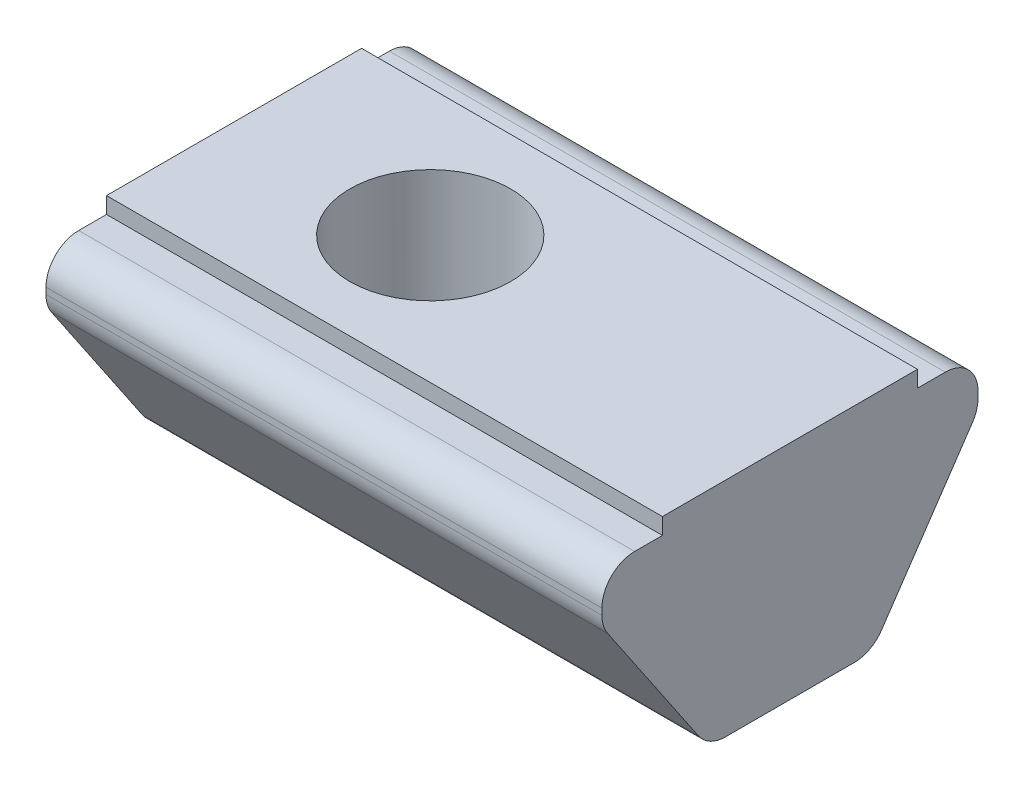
ISO-10303-21;
HEADER;
FILE_DESCRIPTION(('STEP AP214'),'2;1');
FILE_NAME('part.step','',(''),(''),'','','');
FILE_SCHEMA(('AUTOMOTIVE_DESIGN { 1 0 10303 214 1 1 1 1 }'));
ENDSEC;
DATA;
#1=APPLICATION_CONTEXT('core data for automotive mechanical design processes');
#2=APPLICATION_PROTOCOL_DEFINITION('international standard','automotive_design',2000,#1);
#3=PRODUCT_CONTEXT('',#1,'mechanical');
#4=PRODUCT('Part','Part','',(#3));
#5=PRODUCT_RELATED_PRODUCT_CATEGORY('part','',(#4));
#6=PRODUCT_DEFINITION_FORMATION('','',#4);
#7=PRODUCT_DEFINITION_CONTEXT('part definition',#1,'design');
#8=PRODUCT_DEFINITION('design','',#6,#7);
#9=PRODUCT_DEFINITION_SHAPE('','',#8);
#10=(LENGTH_UNIT() NAMED_UNIT(*) SI_UNIT(.MILLI.,.METRE.));
#11=(NAMED_UNIT(*) PLANE_ANGLE_UNIT() SI_UNIT($,.RADIAN.));
#12=(NAMED_UNIT(*) SI_UNIT($,.STERADIAN.) SOLID_ANGLE_UNIT());
#13=UNCERTAINTY_MEASURE_WITH_UNIT(LENGTH_MEASURE(1.E-05),#10,'distance_accuracy_value','');
#14=(GEOMETRIC_REPRESENTATION_CONTEXT(3) GLOBAL_UNCERTAINTY_ASSIGNED_CONTEXT((#13)) GLOBAL_UNIT_ASSIGNED_CONTEXT((#10,
#11,#12)) REPRESENTATION_CONTEXT('',''));
#15=CARTESIAN_POINT('',(0.,0.,0.));
#16=DIRECTION('',(0.,0.,1.));
#17=DIRECTION('',(1.,0.,0.));
#18=AXIS2_PLACEMENT_3D('',#15,#16,#17);
#19=CARTESIAN_POINT('',(11.,-6.8,2.5));
#20=DIRECTION('',(0.,1.,0.));
#21=DIRECTION('',(0.,0.,1.));
#22=AXIS2_PLACEMENT_3D('',#19,#20,#21);
#23=PLANE('',#22);
#24=DIRECTION('',(-1.,0.,0.));
#25=VECTOR('',#24,1.);
#26=CARTESIAN_POINT('',(11.,-6.8,1.96942367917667));
#27=LINE('',#26,#25);
#28=CARTESIAN_POINT('',(6.21786491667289,-6.8,1.96942367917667));
#29=VERTEX_POINT('',#28);
#30=CARTESIAN_POINT('',(1.47159526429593,-6.8,1.96942367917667));
#31=VERTEX_POINT('',#30);
#32=EDGE_CURVE('E197',#29,#31,#27,.T.);
#33=ORIENTED_EDGE('',*,*,#32,.T.);
#34=CARTESIAN_POINT('',(0.,-6.8,0.));
#35=DIRECTION('',(0.,1.,0.));
#36=DIRECTION('',(0.,0.,1.));
#37=AXIS2_PLACEMENT_3D('',#34,#35,#36);
#38=CIRCLE('',#37,2.4585);
#39=CARTESIAN_POINT('',(1.47159526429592,-6.8,-1.96942367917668));
#40=VERTEX_POINT('',#39);
#41=EDGE_CURVE('E54',#31,#40,#38,.T.);
#42=ORIENTED_EDGE('',*,*,#41,.T.);
#43=DIRECTION('',(-1.,0.,0.));
#44=VECTOR('',#43,1.);
#45=CARTESIAN_POINT('',(11.,-6.8,-1.96942367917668));
#46=LINE('',#45,#44);
#47=CARTESIAN_POINT('',(6.2178649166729,-6.8,-1.96942367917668));
#48=VERTEX_POINT('',#47);
#49=EDGE_CURVE('E61',#40,#48,#46,.F.);
#50=ORIENTED_EDGE('',*,*,#49,.T.);
#51=CARTESIAN_POINT('',(7.5,-6.8,0.));
#52=DIRECTION('',(0.,1.,0.));
#53=DIRECTION('',(0.,0.,1.));
#54=AXIS2_PLACEMENT_3D('',#51,#52,#53);
#55=CIRCLE('',#54,2.35);
#56=EDGE_CURVE('E329',#48,#29,#55,.T.);
#57=ORIENTED_EDGE('',*,*,#56,.T.);
#58=EDGE_LOOP('',(#33,#42,#50,#57));
#59=FACE_BOUND('',#58,.T.);
#60=ADVANCED_FACE('F34',(#59),#23,.F.);
#61=CARTESIAN_POINT('',(7.5,-6.6,0.));
#62=DIRECTION('',(0.,-1.,0.));
#63=DIRECTION('',(0.,0.,-1.));
#64=AXIS2_PLACEMENT_3D('',#61,#62,#63);
#65=PLANE('',#64);
#66=CARTESIAN_POINT('',(7.5,-6.6,0.));
#67=DIRECTION('',(0.,1.,0.));
#68=DIRECTION('',(0.,0.,1.));
#69=AXIS2_PLACEMENT_3D('',#66,#67,#68);
#70=CIRCLE('',#69,2.35);
#71=CARTESIAN_POINT('',(7.5,-6.6,2.35));
#72=VERTEX_POINT('',#71);
#73=EDGE_CURVE('E438',#72,#72,#70,.T.);
#74=ORIENTED_EDGE('',*,*,#73,.F.);
#75=EDGE_LOOP('',(#74));
#76=FACE_BOUND('',#75,.T.);
#77=CARTESIAN_POINT('',(7.5,-6.6,0.));
#78=DIRECTION('',(0.,1.,0.));
#79=DIRECTION('',(0.,0.,1.));
#80=AXIS2_PLACEMENT_3D('',#77,#78,#79);
#81=CIRCLE('',#80,1.98997487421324);
#82=CARTESIAN_POINT('',(7.5,-6.6,1.98997487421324));
#83=VERTEX_POINT('',#82);
#84=EDGE_CURVE('E435',#83,#83,#81,.T.);
#85=ORIENTED_EDGE('',*,*,#84,.T.);
#86=EDGE_LOOP('',(#85));
#87=FACE_BOUND('',#86,.T.);
#88=ADVANCED_FACE('F241',(#76,#87),#65,.T.);
#89=CARTESIAN_POINT('',(-6.,-6.8,-1.96942367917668));
#90=VERTEX_POINT('',#89);
#91=CARTESIAN_POINT('',(-1.47159526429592,-6.8,-1.96942367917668));
#92=VERTEX_POINT('',#91);
#93=EDGE_CURVE('E190',#90,#92,#46,.F.);
#94=ORIENTED_EDGE('',*,*,#93,.T.);
#95=CARTESIAN_POINT('',(-1.47159526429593,-6.8,1.96942367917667));
#96=VERTEX_POINT('',#95);
#97=EDGE_CURVE('E177',#92,#96,#38,.T.);
#98=ORIENTED_EDGE('',*,*,#97,.T.);
#99=CARTESIAN_POINT('',(-6.,-6.8,1.96942367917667));
#100=VERTEX_POINT('',#99);
#101=EDGE_CURVE('E187',#96,#100,#27,.T.);
#102=ORIENTED_EDGE('',*,*,#101,.T.);
#103=DIRECTION('',(0.,0.,-1.));
#104=VECTOR('',#103,1.);
#105=CARTESIAN_POINT('',(-6.,-6.8,2.5));
#106=LINE('',#105,#104);
#107=EDGE_CURVE('E398',#100,#90,#106,.T.);
#108=ORIENTED_EDGE('',*,*,#107,.T.);
#109=EDGE_LOOP('',(#94,#98,#102,#108));
#110=FACE_BOUND('',#109,.T.);
#111=ADVANCED_FACE('F185',(#110),#23,.F.);
#112=CARTESIAN_POINT('',(8.78213508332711,-6.8,1.96942367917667));
#113=VERTEX_POINT('',#112);
#114=CARTESIAN_POINT('',(8.78213508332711,-6.8,-1.96942367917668));
#115=VERTEX_POINT('',#114);
#116=EDGE_CURVE('E256',#113,#115,#55,.T.);
#117=ORIENTED_EDGE('',*,*,#116,.T.);
#118=CARTESIAN_POINT('',(11.,-6.8,-1.96942367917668));
#119=VERTEX_POINT('',#118);
#120=EDGE_CURVE('E201',#115,#119,#46,.F.);
#121=ORIENTED_EDGE('',*,*,#120,.T.);
#122=DIRECTION('',(0.,0.,-1.));
#123=VECTOR('',#122,1.);
#124=CARTESIAN_POINT('',(11.,-6.8,2.5));
#125=LINE('',#124,#123);
#126=CARTESIAN_POINT('',(11.,-6.8,1.96942367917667));
#127=VERTEX_POINT('',#126);
#128=EDGE_CURVE('E420',#127,#119,#125,.T.);
#129=ORIENTED_EDGE('',*,*,#128,.F.);
#130=EDGE_CURVE('E199',#127,#113,#27,.T.);
#131=ORIENTED_EDGE('',*,*,#130,.T.);
#132=EDGE_LOOP('',(#117,#121,#129,#131));
#133=FACE_BOUND('',#132,.T.);
#134=ADVANCED_FACE('F263',(#133),#23,.F.);
#135=CARTESIAN_POINT('',(11.,-5.8,1.96942367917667));
#136=DIRECTION('',(-1.,0.,0.));
#137=DIRECTION('',(0.,0.,1.));
#138=AXIS2_PLACEMENT_3D('',#135,#136,#137);
#139=CYLINDRICAL_SURFACE('',#138,1.);
#140=CARTESIAN_POINT('',(1.47159526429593,-6.8,1.96942367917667));
#141=CARTESIAN_POINT('',(1.42306226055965,-6.79998169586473,2.00569675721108));
#142=CARTESIAN_POINT('',(1.37322881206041,-6.79802838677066,2.04012966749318));
#143=CARTESIAN_POINT('',(1.27136263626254,-6.79129349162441,2.10511159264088));
#144=CARTESIAN_POINT('',(1.21933310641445,-6.78651589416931,2.13566601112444));
#145=CARTESIAN_POINT('',(1.11318285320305,-6.77515167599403,2.19287396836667));
#146=CARTESIAN_POINT('',(1.05905646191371,-6.76855980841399,2.21951584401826));
#147=CARTESIAN_POINT('',(0.949069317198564,-6.7545015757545,2.26872655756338));
#148=CARTESIAN_POINT('',(0.893207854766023,-6.74703484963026,2.29129370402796));
#149=CARTESIAN_POINT('',(0.777285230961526,-6.73174924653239,2.33324411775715));
#150=CARTESIAN_POINT('',(0.717150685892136,-6.72393050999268,2.35242492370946));
#151=CARTESIAN_POINT('',(0.595479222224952,-6.70922787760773,2.38612883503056));
#152=CARTESIAN_POINT('',(0.533942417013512,-6.70234390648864,2.40065231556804));
#153=CARTESIAN_POINT('',(0.409935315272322,-6.69034932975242,2.42490297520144));
#154=CARTESIAN_POINT('',(0.3474681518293,-6.6852337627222,2.43464360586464));
#155=CARTESIAN_POINT('',(0.221818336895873,-6.67738164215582,2.44928942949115));
#156=CARTESIAN_POINT('',(0.158635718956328,-6.67464497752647,2.45419484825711));
#157=CARTESIAN_POINT('',(0.0293997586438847,-6.67184852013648,2.45920910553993));
#158=CARTESIAN_POINT('',(-0.0366643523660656,-6.67190397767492,2.45911142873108));
#159=CARTESIAN_POINT('',(-0.168502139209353,-6.67497222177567,2.45360632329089));
#160=CARTESIAN_POINT('',(-0.234275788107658,-6.67798527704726,2.44819841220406));
#161=CARTESIAN_POINT('',(-0.365209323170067,-6.68656352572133,2.4321198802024));
#162=CARTESIAN_POINT('',(-0.430366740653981,-6.6921364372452,2.42143333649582));
#163=CARTESIAN_POINT('',(-0.559441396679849,-6.70508357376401,2.39491059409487));
#164=CARTESIAN_POINT('',(-0.623358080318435,-6.71245858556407,2.37907214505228));
#165=CARTESIAN_POINT('',(-0.807497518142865,-6.73523897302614,2.32551578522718));
#166=CARTESIAN_POINT('',(-0.925715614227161,-6.75181649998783,2.28103992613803));
#167=CARTESIAN_POINT('',(-1.09688437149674,-6.773168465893,2.2011419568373));
#168=CARTESIAN_POINT('',(-1.15283134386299,-6.77969257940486,2.17236729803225));
#169=CARTESIAN_POINT('',(-1.26250969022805,-6.79049652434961,2.11050752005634));
#170=CARTESIAN_POINT('',(-1.31624272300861,-6.79477806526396,2.07742570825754));
#171=CARTESIAN_POINT('',(-1.40357920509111,-6.79904826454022,2.01890117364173));
#172=CARTESIAN_POINT('',(-1.43790836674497,-6.79999341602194,1.99460052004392));
#173=CARTESIAN_POINT('',(-1.47159526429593,-6.8,1.96942367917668));
#174=B_SPLINE_CURVE_WITH_KNOTS('',3,(#140,#141,#142,#143,#144,#145,#146,#147,#148,#149,#150,
#151,#152,#153,#154,#155,#156,#157,#158,#159,#160,#161,#162,#163,#164,#165,#166,#167,#168,#169,
#170,#171,#172,#173),.UNSPECIFIED.,.F.,.F.,(4,2,2,2,2,2,2,2,2,2,2,2,2,2,2,2,4),(0.,
0.181614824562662,0.362973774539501,0.544862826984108,0.726827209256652,0.917445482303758,
1.10804839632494,1.29811213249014,1.4881669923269,1.68607292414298,1.88399683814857,
2.08252146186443,2.28113291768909,2.66151335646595,2.85111024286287,3.04056239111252,
3.16669757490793),.UNSPECIFIED.);
#175=EDGE_CURVE('E11',#31,#96,#174,.T.);
#176=ORIENTED_EDGE('',*,*,#175,.F.);
#177=ORIENTED_EDGE('',*,*,#32,.F.);
#178=CARTESIAN_POINT('',(6.21786491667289,-6.8,1.96942367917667));
#179=CARTESIAN_POINT('',(6.26941318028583,-6.7999783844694,2.00298939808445));
#180=CARTESIAN_POINT('',(6.32224458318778,-6.79831126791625,2.03449549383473));
#181=CARTESIAN_POINT('',(6.43007862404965,-6.79275195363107,2.09320956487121));
#182=CARTESIAN_POINT('',(6.48507930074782,-6.78886172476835,2.12042131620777));
#183=CARTESIAN_POINT('',(6.5970877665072,-6.77990723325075,2.17048964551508));
#184=CARTESIAN_POINT('',(6.65410018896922,-6.77484008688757,2.19333527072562));
#185=CARTESIAN_POINT('',(6.76973175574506,-6.76446242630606,2.2344965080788));
#186=CARTESIAN_POINT('',(6.8283512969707,-6.75915185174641,2.25281098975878));
#187=CARTESIAN_POINT('',(6.94888236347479,-6.74894438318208,2.28534355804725));
#188=CARTESIAN_POINT('',(7.01083836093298,-6.74406733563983,2.2994036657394));
#189=CARTESIAN_POINT('',(7.13577445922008,-6.7356860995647,2.32247152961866));
#190=CARTESIAN_POINT('',(7.19875446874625,-6.73218178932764,2.33147973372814));
#191=CARTESIAN_POINT('',(7.32518942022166,-6.72708124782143,2.34434859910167));
#192=CARTESIAN_POINT('',(7.38864313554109,-6.72548114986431,2.34821969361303));
#193=CARTESIAN_POINT('',(7.51567264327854,-6.72441846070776,2.3508062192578));
#194=CARTESIAN_POINT('',(7.57924843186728,-6.72495580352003,2.34952180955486));
#195=CARTESIAN_POINT('',(7.70530115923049,-6.72806792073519,2.34185667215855));
#196=CARTESIAN_POINT('',(7.76778230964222,-6.73061909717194,2.33553496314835));
#197=CARTESIAN_POINT('',(7.89195507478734,-6.73735308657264,2.31793111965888));
#198=CARTESIAN_POINT('',(7.95364659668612,-6.7415360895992,2.30664840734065));
#199=CARTESIAN_POINT('',(8.07590856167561,-6.75091949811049,2.27920115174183));
#200=CARTESIAN_POINT('',(8.13647799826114,-6.75612077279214,2.26303243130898));
#201=CARTESIAN_POINT('',(8.25611724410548,-6.76673811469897,2.22591828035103));
#202=CARTESIAN_POINT('',(8.31518681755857,-6.77215421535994,2.20497210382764));
#203=CARTESIAN_POINT('',(8.44469791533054,-6.78341725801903,2.15312433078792));
#204=CARTESIAN_POINT('',(8.51469137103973,-6.78908479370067,2.1210426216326));
#205=CARTESIAN_POINT('',(8.61707529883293,-6.79530060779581,2.06787787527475));
#206=CARTESIAN_POINT('',(8.65073584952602,-6.7969910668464,2.04933742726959));
#207=CARTESIAN_POINT('',(8.71714378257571,-6.79933946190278,2.01060666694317));
#208=CARTESIAN_POINT('',(8.74989087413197,-6.79999707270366,1.99041583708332));
#209=CARTESIAN_POINT('',(8.78213508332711,-6.8,1.96942367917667));
#210=B_SPLINE_CURVE_WITH_KNOTS('',3,(#178,#179,#180,#181,#182,#183,#184,#185,#186,#187,#188,
#189,#190,#191,#192,#193,#194,#195,#196,#197,#198,#199,#200,#201,#202,#203,#204,#205,#206,#207,
#208,#209),.UNSPECIFIED.,.F.,.F.,(4,2,2,2,2,2,2,2,2,2,2,2,2,2,2,4),(0.,0.184403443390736,
0.368643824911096,0.553340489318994,0.738083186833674,0.929021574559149,1.11994303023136,
1.31047613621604,1.50100335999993,1.6893305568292,1.87767969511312,2.06619031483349,
2.25473039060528,2.4858939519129,2.6012403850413,2.71662312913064),.UNSPECIFIED.);
#211=EDGE_CURVE('E247',#29,#113,#210,.T.);
#212=ORIENTED_EDGE('',*,*,#211,.T.);
#213=ORIENTED_EDGE('',*,*,#130,.F.);
#214=CARTESIAN_POINT('',(11.,-5.8,1.96942367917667));
#215=DIRECTION('',(1.,0.,0.));
#216=DIRECTION('',(0.,0.,-1.));
#217=AXIS2_PLACEMENT_3D('',#214,#215,#216);
#218=CIRCLE('',#217,1.);
#219=CARTESIAN_POINT('',(11.,-6.36065740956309,2.79747154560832));
#220=VERTEX_POINT('',#219);
#221=EDGE_CURVE('E344',#220,#127,#218,.T.);
#222=ORIENTED_EDGE('',*,*,#221,.F.);
#223=DIRECTION('',(-1.,0.,0.));
#224=VECTOR('',#223,1.);
#225=CARTESIAN_POINT('',(11.,-6.36065740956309,2.79747154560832));
#226=LINE('',#225,#224);
#227=CARTESIAN_POINT('',(-6.,-6.36065740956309,2.79747154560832));
#228=VERTEX_POINT('',#227);
#229=EDGE_CURVE('E336',#228,#220,#226,.F.);
#230=ORIENTED_EDGE('',*,*,#229,.F.);
#231=CARTESIAN_POINT('',(-6.,-5.8,1.96942367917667));
#232=DIRECTION('',(1.,0.,0.));
#233=DIRECTION('',(0.,0.,-1.));
#234=AXIS2_PLACEMENT_3D('',#231,#232,#233);
#235=CIRCLE('',#234,1.);
#236=EDGE_CURVE('E195',#100,#228,#235,.F.);
#237=ORIENTED_EDGE('',*,*,#236,.F.);
#238=ORIENTED_EDGE('',*,*,#101,.F.);
#239=EDGE_LOOP('',(#176,#177,#212,#213,#222,#230,#237,#238));
#240=FACE_BOUND('',#239,.T.);
#241=ADVANCED_FACE('F193',(#240),#139,.T.);
#242=CARTESIAN_POINT('',(11.,-5.8,-1.96942367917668));
#243=DIRECTION('',(-1.,0.,0.));
#244=DIRECTION('',(0.,0.,1.));
#245=AXIS2_PLACEMENT_3D('',#242,#243,#244);
#246=CYLINDRICAL_SURFACE('',#245,1.);
#247=CARTESIAN_POINT('',(-1.47159526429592,-6.8,-1.96942367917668));
#248=CARTESIAN_POINT('',(-1.42306226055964,-6.79998169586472,-2.00569675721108));
#249=CARTESIAN_POINT('',(-1.3732288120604,-6.79802838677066,-2.04012966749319));
#250=CARTESIAN_POINT('',(-1.27136263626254,-6.79129349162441,-2.10511159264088));
#251=CARTESIAN_POINT('',(-1.21933310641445,-6.78651589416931,-2.13566601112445));
#252=CARTESIAN_POINT('',(-1.11318285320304,-6.77515167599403,-2.19287396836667));
#253=CARTESIAN_POINT('',(-1.0590564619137,-6.76855980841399,-2.21951584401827));
#254=CARTESIAN_POINT('',(-0.949069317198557,-6.7545015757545,-2.26872655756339));
#255=CARTESIAN_POINT('',(-0.893207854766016,-6.74703484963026,-2.29129370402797));
#256=CARTESIAN_POINT('',(-0.777285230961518,-6.73174924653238,-2.33324411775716));
#257=CARTESIAN_POINT('',(-0.717150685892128,-6.72393050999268,-2.35242492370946));
#258=CARTESIAN_POINT('',(-0.595479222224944,-6.70922787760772,-2.38612883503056));
#259=CARTESIAN_POINT('',(-0.533942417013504,-6.70234390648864,-2.40065231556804));
#260=CARTESIAN_POINT('',(-0.409935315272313,-6.69034932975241,-2.42490297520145));
#261=CARTESIAN_POINT('',(-0.347468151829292,-6.6852337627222,-2.43464360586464));
#262=CARTESIAN_POINT('',(-0.221818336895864,-6.67738164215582,-2.44928942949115));
#263=CARTESIAN_POINT('',(-0.158635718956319,-6.67464497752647,-2.45419484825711));
#264=CARTESIAN_POINT('',(-0.0293997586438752,-6.67184852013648,-2.45920910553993));
#265=CARTESIAN_POINT('',(0.0366643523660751,-6.67190397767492,-2.45911142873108));
#266=CARTESIAN_POINT('',(0.168502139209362,-6.67497222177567,-2.45360632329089));
#267=CARTESIAN_POINT('',(0.234275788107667,-6.67798527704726,-2.44819841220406));
#268=CARTESIAN_POINT('',(0.365209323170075,-6.68656352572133,-2.4321198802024));
#269=CARTESIAN_POINT('',(0.430366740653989,-6.6921364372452,-2.42143333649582));
#270=CARTESIAN_POINT('',(0.559441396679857,-6.70508357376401,-2.39491059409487));
#271=CARTESIAN_POINT('',(0.623358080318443,-6.71245858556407,-2.37907214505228));
#272=CARTESIAN_POINT('',(0.807497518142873,-6.73523897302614,-2.32551578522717));
#273=CARTESIAN_POINT('',(0.925715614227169,-6.75181649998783,-2.28103992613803));
#274=CARTESIAN_POINT('',(1.09688437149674,-6.773168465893,-2.20114195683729));
#275=CARTESIAN_POINT('',(1.152831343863,-6.77969257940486,-2.17236729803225));
#276=CARTESIAN_POINT('',(1.26250969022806,-6.79049652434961,-2.11050752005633));
#277=CARTESIAN_POINT('',(1.31624272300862,-6.79477806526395,-2.07742570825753));
#278=CARTESIAN_POINT('',(1.40357920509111,-6.79904826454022,-2.01890117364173));
#279=CARTESIAN_POINT('',(1.43790836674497,-6.79999341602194,-1.99460052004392));
#280=CARTESIAN_POINT('',(1.47159526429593,-6.8,-1.96942367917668));
#281=B_SPLINE_CURVE_WITH_KNOTS('',3,(#247,#248,#249,#250,#251,#252,#253,#254,#255,#256,#257,
#258,#259,#260,#261,#262,#263,#264,#265,#266,#267,#268,#269,#270,#271,#272,#273,#274,#275,#276,
#277,#278,#279,#280),.UNSPECIFIED.,.F.,.F.,(4,2,2,2,2,2,2,2,2,2,2,2,2,2,2,2,4),(0.,
0.181614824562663,0.362973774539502,0.544862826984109,0.726827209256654,0.917445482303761,
1.10804839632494,1.29811213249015,1.4881669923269,1.68607292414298,1.88399683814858,
2.08252146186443,2.28113291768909,2.66151335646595,2.85111024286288,3.04056239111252,
3.16669757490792),.UNSPECIFIED.);
#282=EDGE_CURVE('E434',#92,#40,#281,.T.);
#283=ORIENTED_EDGE('',*,*,#282,.F.);
#284=ORIENTED_EDGE('',*,*,#93,.F.);
#285=CARTESIAN_POINT('',(-6.,-5.8,-1.96942367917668));
#286=DIRECTION('',(1.,0.,0.));
#287=DIRECTION('',(0.,0.,-1.));
#288=AXIS2_PLACEMENT_3D('',#285,#286,#287);
#289=CIRCLE('',#288,1.);
#290=CARTESIAN_POINT('',(-6.,-6.36065740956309,-2.79747154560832));
#291=VERTEX_POINT('',#290);
#292=EDGE_CURVE('E358',#291,#90,#289,.F.);
#293=ORIENTED_EDGE('',*,*,#292,.F.);
#294=DIRECTION('',(-1.,0.,0.));
#295=VECTOR('',#294,1.);
#296=CARTESIAN_POINT('',(11.,-6.36065740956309,-2.79747154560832));
#297=LINE('',#296,#295);
#298=CARTESIAN_POINT('',(11.,-6.36065740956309,-2.79747154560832));
#299=VERTEX_POINT('',#298);
#300=EDGE_CURVE('E209',#299,#291,#297,.T.);
#301=ORIENTED_EDGE('',*,*,#300,.F.);
#302=CARTESIAN_POINT('',(11.,-5.8,-1.96942367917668));
#303=DIRECTION('',(1.,0.,0.));
#304=DIRECTION('',(0.,0.,-1.));
#305=AXIS2_PLACEMENT_3D('',#302,#303,#304);
#306=CIRCLE('',#305,1.);
#307=EDGE_CURVE('E333',#119,#299,#306,.T.);
#308=ORIENTED_EDGE('',*,*,#307,.F.);
#309=ORIENTED_EDGE('',*,*,#120,.F.);
#310=CARTESIAN_POINT('',(8.7821350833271,-6.8,-1.96942367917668));
#311=CARTESIAN_POINT('',(8.73058681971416,-6.7999783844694,-2.00298939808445));
#312=CARTESIAN_POINT('',(8.67775541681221,-6.79831126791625,-2.03449549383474));
#313=CARTESIAN_POINT('',(8.56992137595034,-6.79275195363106,-2.09320956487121));
#314=CARTESIAN_POINT('',(8.51492069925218,-6.78886172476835,-2.12042131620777));
#315=CARTESIAN_POINT('',(8.40291223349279,-6.77990723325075,-2.17048964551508));
#316=CARTESIAN_POINT('',(8.34589981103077,-6.77484008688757,-2.19333527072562));
#317=CARTESIAN_POINT('',(8.23026824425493,-6.76446242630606,-2.23449650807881));
#318=CARTESIAN_POINT('',(8.17164870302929,-6.75915185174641,-2.25281098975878));
#319=CARTESIAN_POINT('',(8.0511176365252,-6.74894438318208,-2.28534355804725));
#320=CARTESIAN_POINT('',(7.98916163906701,-6.74406733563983,-2.2994036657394));
#321=CARTESIAN_POINT('',(7.8642255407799,-6.7356860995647,-2.32247152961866));
#322=CARTESIAN_POINT('',(7.80124553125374,-6.73218178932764,-2.33147973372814));
#323=CARTESIAN_POINT('',(7.67481057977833,-6.72708124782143,-2.34434859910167));
#324=CARTESIAN_POINT('',(7.6113568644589,-6.72548114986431,-2.34821969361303));
#325=CARTESIAN_POINT('',(7.48432735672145,-6.72441846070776,-2.35080621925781));
#326=CARTESIAN_POINT('',(7.42075156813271,-6.72495580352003,-2.34952180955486));
#327=CARTESIAN_POINT('',(7.2946988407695,-6.72806792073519,-2.34185667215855));
#328=CARTESIAN_POINT('',(7.23221769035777,-6.73061909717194,-2.33553496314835));
#329=CARTESIAN_POINT('',(7.10804492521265,-6.73735308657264,-2.31793111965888));
#330=CARTESIAN_POINT('',(7.04635340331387,-6.7415360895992,-2.30664840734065));
#331=CARTESIAN_POINT('',(6.92409143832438,-6.75091949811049,-2.27920115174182));
#332=CARTESIAN_POINT('',(6.86352200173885,-6.75612077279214,-2.26303243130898));
#333=CARTESIAN_POINT('',(6.74388275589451,-6.76673811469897,-2.22591828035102));
#334=CARTESIAN_POINT('',(6.68481318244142,-6.77215421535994,-2.20497210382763));
#335=CARTESIAN_POINT('',(6.55530208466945,-6.78341725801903,-2.15312433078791));
#336=CARTESIAN_POINT('',(6.48530862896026,-6.78908479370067,-2.1210426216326));
#337=CARTESIAN_POINT('',(6.38292470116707,-6.79530060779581,-2.06787787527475));
#338=CARTESIAN_POINT('',(6.34926415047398,-6.79699106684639,-2.0493374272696));
#339=CARTESIAN_POINT('',(6.2828562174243,-6.79933946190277,-2.01060666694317));
#340=CARTESIAN_POINT('',(6.25010912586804,-6.79999707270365,-1.99041583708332));
#341=CARTESIAN_POINT('',(6.2178649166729,-6.8,-1.96942367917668));
#342=B_SPLINE_CURVE_WITH_KNOTS('',3,(#310,#311,#312,#313,#314,#315,#316,#317,#318,#319,#320,
#321,#322,#323,#324,#325,#326,#327,#328,#329,#330,#331,#332,#333,#334,#335,#336,#337,#338,#339,
#340,#341),.UNSPECIFIED.,.F.,.F.,(4,2,2,2,2,2,2,2,2,2,2,2,2,2,2,4),(0.,0.184403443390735,
0.368643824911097,0.553340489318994,0.738083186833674,0.929021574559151,1.11994303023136,
1.31047613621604,1.50100335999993,1.6893305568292,1.87767969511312,2.06619031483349,
2.25473039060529,2.48589395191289,2.60124038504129,2.71662312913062),.UNSPECIFIED.);
#343=EDGE_CURVE('E48',#115,#48,#342,.T.);
#344=ORIENTED_EDGE('',*,*,#343,.T.);
#345=ORIENTED_EDGE('',*,*,#49,.F.);
#346=EDGE_LOOP('',(#283,#284,#293,#301,#308,#309,#344,#345));
#347=FACE_BOUND('',#346,.T.);
#348=ADVANCED_FACE('F232',(#347),#246,.T.);
#349=CARTESIAN_POINT('',(11.,-0.500000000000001,5.75));
#350=DIRECTION('',(0.,0.,-1.));
#351=DIRECTION('',(-1.,0.,0.));
#352=AXIS2_PLACEMENT_3D('',#349,#350,#351);
#353=PLANE('',#352);
#354=DIRECTION('',(0.,-1.,0.));
#355=VECTOR('',#354,1.);
#356=CARTESIAN_POINT('',(11.,-0.500000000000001,5.75));
#357=LINE('',#356,#355);
#358=CARTESIAN_POINT('',(11.,-1.5,5.75));
#359=VERTEX_POINT('',#358);
#360=CARTESIAN_POINT('',(11.,-1.69330266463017,5.75));
#361=VERTEX_POINT('',#360);
#362=EDGE_CURVE('E258',#359,#361,#357,.T.);
#363=ORIENTED_EDGE('',*,*,#362,.F.);
#364=DIRECTION('',(-1.,0.,0.));
#365=VECTOR('',#364,1.);
#366=CARTESIAN_POINT('',(11.,-1.5,5.75));
#367=LINE('',#366,#365);
#368=CARTESIAN_POINT('',(-6.,-1.5,5.75));
#369=VERTEX_POINT('',#368);
#370=EDGE_CURVE('E364',#359,#369,#367,.T.);
#371=ORIENTED_EDGE('',*,*,#370,.T.);
#372=DIRECTION('',(0.,-1.,0.));
#373=VECTOR('',#372,1.);
#374=CARTESIAN_POINT('',(-6.,-0.500000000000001,5.75));
#375=LINE('',#374,#373);
#376=CARTESIAN_POINT('',(-6.,-1.69330266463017,5.75));
#377=VERTEX_POINT('',#376);
#378=EDGE_CURVE('E255',#369,#377,#375,.T.);
#379=ORIENTED_EDGE('',*,*,#378,.T.);
#380=DIRECTION('',(-1.,0.,0.));
#381=VECTOR('',#380,1.);
#382=CARTESIAN_POINT('',(11.,-1.69330266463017,5.75));
#383=LINE('',#382,#381);
#384=EDGE_CURVE('E367',#377,#361,#383,.F.);
#385=ORIENTED_EDGE('',*,*,#384,.T.);
#386=EDGE_LOOP('',(#363,#371,#379,#385));
#387=FACE_BOUND('',#386,.T.);
#388=ADVANCED_FACE('F275',(#387),#353,.F.);
#389=CARTESIAN_POINT('',(11.,-2.,5.75));
#390=DIRECTION('',(0.,0.560657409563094,-0.828047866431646));
#391=DIRECTION('',(0.,0.828047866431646,0.560657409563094));
#392=AXIS2_PLACEMENT_3D('',#389,#390,#391);
#393=PLANE('',#392);
#394=DIRECTION('',(0.,-0.828047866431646,-0.560657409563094));
#395=VECTOR('',#394,1.);
#396=CARTESIAN_POINT('',(11.,-2.,5.75));
#397=LINE('',#396,#395);
#398=CARTESIAN_POINT('',(11.,-2.25396007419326,5.57804786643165));
#399=VERTEX_POINT('',#398);
#400=EDGE_CURVE('E421',#399,#220,#397,.T.);
#401=ORIENTED_EDGE('',*,*,#400,.F.);
#402=DIRECTION('',(-1.,0.,0.));
#403=VECTOR('',#402,1.);
#404=CARTESIAN_POINT('',(11.,-2.25396007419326,5.57804786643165));
#405=LINE('',#404,#403);
#406=CARTESIAN_POINT('',(-6.,-2.25396007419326,5.57804786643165));
#407=VERTEX_POINT('',#406);
#408=EDGE_CURVE('E334',#399,#407,#405,.T.);
#409=ORIENTED_EDGE('',*,*,#408,.T.);
#410=DIRECTION('',(0.,-0.828047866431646,-0.560657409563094));
#411=VECTOR('',#410,1.);
#412=CARTESIAN_POINT('',(-6.,-2.,5.75));
#413=LINE('',#412,#411);
#414=EDGE_CURVE('E400',#407,#228,#413,.T.);
#415=ORIENTED_EDGE('',*,*,#414,.T.);
#416=ORIENTED_EDGE('',*,*,#229,.T.);
#417=EDGE_LOOP('',(#401,#409,#415,#416));
#418=FACE_BOUND('',#417,.T.);
#419=ADVANCED_FACE('F278',(#418),#393,.F.);
#420=CARTESIAN_POINT('',(11.,-6.8,-2.5));
#421=DIRECTION('',(0.,0.560657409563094,0.828047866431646));
#422=DIRECTION('',(0.,-0.828047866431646,0.560657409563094));
#423=AXIS2_PLACEMENT_3D('',#420,#421,#422);
#424=PLANE('',#423);
#425=DIRECTION('',(0.,0.828047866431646,-0.560657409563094));
#426=VECTOR('',#425,1.);
#427=CARTESIAN_POINT('',(11.,-6.8,-2.5));
#428=LINE('',#427,#426);
#429=CARTESIAN_POINT('',(11.,-2.25396007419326,-5.57804786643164));
#430=VERTEX_POINT('',#429);
#431=EDGE_CURVE('E418',#299,#430,#428,.T.);
#432=ORIENTED_EDGE('',*,*,#431,.F.);
#433=ORIENTED_EDGE('',*,*,#300,.T.);
#434=DIRECTION('',(0.,0.828047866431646,-0.560657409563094));
#435=VECTOR('',#434,1.);
#436=CARTESIAN_POINT('',(-6.,-6.8,-2.5));
#437=LINE('',#436,#435);
#438=CARTESIAN_POINT('',(-6.,-2.25396007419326,-5.57804786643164));
#439=VERTEX_POINT('',#438);
#440=EDGE_CURVE('E396',#291,#439,#437,.T.);
#441=ORIENTED_EDGE('',*,*,#440,.T.);
#442=DIRECTION('',(-1.,0.,0.));
#443=VECTOR('',#442,1.);
#444=CARTESIAN_POINT('',(11.,-2.25396007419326,-5.57804786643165));
#445=LINE('',#444,#443);
#446=EDGE_CURVE('E204',#439,#430,#445,.F.);
#447=ORIENTED_EDGE('',*,*,#446,.T.);
#448=EDGE_LOOP('',(#432,#433,#441,#447));
#449=FACE_BOUND('',#448,.T.);
#450=ADVANCED_FACE('F282',(#449),#424,.F.);
#451=CARTESIAN_POINT('',(11.,-2.,-5.75));
#452=DIRECTION('',(0.,0.,1.));
#453=DIRECTION('',(1.,0.,0.));
#454=AXIS2_PLACEMENT_3D('',#451,#452,#453);
#455=PLANE('',#454);
#456=DIRECTION('',(0.,1.,0.));
#457=VECTOR('',#456,1.);
#458=CARTESIAN_POINT('',(11.,-2.,-5.75));
#459=LINE('',#458,#457);
#460=CARTESIAN_POINT('',(11.,-1.69330266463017,-5.75));
#461=VERTEX_POINT('',#460);
#462=CARTESIAN_POINT('',(11.,-1.5,-5.75));
#463=VERTEX_POINT('',#462);
#464=EDGE_CURVE('E415',#461,#463,#459,.T.);
#465=ORIENTED_EDGE('',*,*,#464,.F.);
#466=DIRECTION('',(-1.,0.,0.));
#467=VECTOR('',#466,1.);
#468=CARTESIAN_POINT('',(11.,-1.69330266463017,-5.75));
#469=LINE('',#468,#467);
#470=CARTESIAN_POINT('',(-6.,-1.69330266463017,-5.75));
#471=VERTEX_POINT('',#470);
#472=EDGE_CURVE('E220',#461,#471,#469,.T.);
#473=ORIENTED_EDGE('',*,*,#472,.T.);
#474=DIRECTION('',(0.,1.,0.));
#475=VECTOR('',#474,1.);
#476=CARTESIAN_POINT('',(-6.,-2.,-5.75));
#477=LINE('',#476,#475);
#478=CARTESIAN_POINT('',(-6.,-1.5,-5.75));
#479=VERTEX_POINT('',#478);
#480=EDGE_CURVE('E393',#471,#479,#477,.T.);
#481=ORIENTED_EDGE('',*,*,#480,.T.);
#482=DIRECTION('',(-1.,0.,0.));
#483=VECTOR('',#482,1.);
#484=CARTESIAN_POINT('',(11.,-1.5,-5.75));
#485=LINE('',#484,#483);
#486=EDGE_CURVE('E216',#479,#463,#485,.F.);
#487=ORIENTED_EDGE('',*,*,#486,.T.);
#488=EDGE_LOOP('',(#465,#473,#481,#487));
#489=FACE_BOUND('',#488,.T.);
#490=ADVANCED_FACE('F288',(#489),#455,.F.);
#491=CARTESIAN_POINT('',(11.,-0.499999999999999,-5.75));
#492=DIRECTION('',(0.,-1.,0.));
#493=DIRECTION('',(0.,0.,-1.));
#494=AXIS2_PLACEMENT_3D('',#491,#492,#493);
#495=PLANE('',#494);
#496=DIRECTION('',(0.,0.,1.));
#497=VECTOR('',#496,1.);
#498=CARTESIAN_POINT('',(11.,-0.499999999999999,-5.75));
#499=LINE('',#498,#497);
#500=CARTESIAN_POINT('',(11.,-0.499999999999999,-4.75));
#501=VERTEX_POINT('',#500);
#502=CARTESIAN_POINT('',(11.,-0.499999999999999,-3.9));
#503=VERTEX_POINT('',#502);
#504=EDGE_CURVE('E413',#501,#503,#499,.T.);
#505=ORIENTED_EDGE('',*,*,#504,.F.);
#506=DIRECTION('',(-1.,0.,0.));
#507=VECTOR('',#506,1.);
#508=CARTESIAN_POINT('',(11.,-0.499999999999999,-4.75));
#509=LINE('',#508,#507);
#510=CARTESIAN_POINT('',(-6.,-0.499999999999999,-4.75));
#511=VERTEX_POINT('',#510);
#512=EDGE_CURVE('E223',#501,#511,#509,.T.);
#513=ORIENTED_EDGE('',*,*,#512,.T.);
#514=DIRECTION('',(0.,0.,1.));
#515=VECTOR('',#514,1.);
#516=CARTESIAN_POINT('',(-6.,-0.499999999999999,-5.75));
#517=LINE('',#516,#515);
#518=CARTESIAN_POINT('',(-6.,-0.499999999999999,-3.9));
#519=VERTEX_POINT('',#518);
#520=EDGE_CURVE('E391',#511,#519,#517,.T.);
#521=ORIENTED_EDGE('',*,*,#520,.T.);
#522=DIRECTION('',(-1.,0.,0.));
#523=VECTOR('',#522,1.);
#524=CARTESIAN_POINT('',(11.,-0.499999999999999,-3.9));
#525=LINE('',#524,#523);
#526=EDGE_CURVE('E369',#503,#519,#525,.T.);
#527=ORIENTED_EDGE('',*,*,#526,.F.);
#528=EDGE_LOOP('',(#505,#513,#521,#527));
#529=FACE_BOUND('',#528,.T.);
#530=ADVANCED_FACE('F291',(#529),#495,.F.);
#531=CARTESIAN_POINT('',(11.,-0.499999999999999,-3.9));
#532=DIRECTION('',(0.,0.,1.));
#533=DIRECTION('',(1.,0.,0.));
#534=AXIS2_PLACEMENT_3D('',#531,#532,#533);
#535=PLANE('',#534);
#536=DIRECTION('',(0.,1.,0.));
#537=VECTOR('',#536,1.);
#538=CARTESIAN_POINT('',(-6.,-0.499999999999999,-3.9));
#539=LINE('',#538,#537);
#540=CARTESIAN_POINT('',(-6.,0.,-3.9));
#541=VERTEX_POINT('',#540);
#542=EDGE_CURVE('E389',#519,#541,#539,.T.);
#543=ORIENTED_EDGE('',*,*,#542,.T.);
#544=DIRECTION('',(-1.,0.,0.));
#545=VECTOR('',#544,1.);
#546=CARTESIAN_POINT('',(11.,0.,-3.9));
#547=LINE('',#546,#545);
#548=CARTESIAN_POINT('',(11.,0.,-3.9));
#549=VERTEX_POINT('',#548);
#550=EDGE_CURVE('E372',#549,#541,#547,.T.);
#551=ORIENTED_EDGE('',*,*,#550,.F.);
#552=DIRECTION('',(0.,1.,0.));
#553=VECTOR('',#552,1.);
#554=CARTESIAN_POINT('',(11.,-0.499999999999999,-3.9));
#555=LINE('',#554,#553);
#556=EDGE_CURVE('E411',#503,#549,#555,.T.);
#557=ORIENTED_EDGE('',*,*,#556,.F.);
#558=ORIENTED_EDGE('',*,*,#526,.T.);
#559=EDGE_LOOP('',(#543,#551,#557,#558));
#560=FACE_BOUND('',#559,.T.);
#561=ADVANCED_FACE('F295',(#560),#535,.F.);
#562=CARTESIAN_POINT('',(11.,0.,-3.9));
#563=DIRECTION('',(0.,-1.,0.));
#564=DIRECTION('',(0.,0.,-1.));
#565=AXIS2_PLACEMENT_3D('',#562,#563,#564);
#566=PLANE('',#565);
#567=CARTESIAN_POINT('',(0.,0.,0.));
#568=DIRECTION('',(0.,1.,0.));
#569=DIRECTION('',(0.,0.,1.));
#570=AXIS2_PLACEMENT_3D('',#567,#568,#569);
#571=CIRCLE('',#570,2.4585);
#572=CARTESIAN_POINT('',(0.,0.,2.4585));
#573=VERTEX_POINT('',#572);
#574=EDGE_CURVE('E191',#573,#573,#571,.T.);
#575=ORIENTED_EDGE('',*,*,#574,.F.);
#576=EDGE_LOOP('',(#575));
#577=FACE_BOUND('',#576,.T.);
#578=DIRECTION('',(0.,0.,1.));
#579=VECTOR('',#578,1.);
#580=CARTESIAN_POINT('',(-6.,0.,-3.9));
#581=LINE('',#580,#579);
#582=CARTESIAN_POINT('',(-6.,0.,3.9));
#583=VERTEX_POINT('',#582);
#584=EDGE_CURVE('E387',#541,#583,#581,.T.);
#585=ORIENTED_EDGE('',*,*,#584,.T.);
#586=DIRECTION('',(-1.,0.,0.));
#587=VECTOR('',#586,1.);
#588=CARTESIAN_POINT('',(11.,0.,3.9));
#589=LINE('',#588,#587);
#590=CARTESIAN_POINT('',(11.,0.,3.9));
#591=VERTEX_POINT('',#590);
#592=EDGE_CURVE('E375',#591,#583,#589,.T.);
#593=ORIENTED_EDGE('',*,*,#592,.F.);
#594=DIRECTION('',(0.,0.,1.));
#595=VECTOR('',#594,1.);
#596=CARTESIAN_POINT('',(11.,0.,-3.9));
#597=LINE('',#596,#595);
#598=EDGE_CURVE('E409',#549,#591,#597,.T.);
#599=ORIENTED_EDGE('',*,*,#598,.F.);
#600=ORIENTED_EDGE('',*,*,#550,.T.);
#601=EDGE_LOOP('',(#585,#593,#599,#600));
#602=FACE_BOUND('',#601,.T.);
#603=ADVANCED_FACE('F299',(#577,#602),#566,.F.);
#604=CARTESIAN_POINT('',(11.,0.,3.9));
#605=DIRECTION('',(0.,0.,-1.));
#606=DIRECTION('',(0.,1.,0.));
#607=AXIS2_PLACEMENT_3D('',#604,#605,#606);
#608=PLANE('',#607);
#609=DIRECTION('',(0.,-1.,0.));
#610=VECTOR('',#609,1.);
#611=CARTESIAN_POINT('',(-6.,0.,3.9));
#612=LINE('',#611,#610);
#613=CARTESIAN_POINT('',(-6.,-0.5,3.9));
#614=VERTEX_POINT('',#613);
#615=EDGE_CURVE('E385',#583,#614,#612,.T.);
#616=ORIENTED_EDGE('',*,*,#615,.T.);
#617=DIRECTION('',(-1.,0.,0.));
#618=VECTOR('',#617,1.);
#619=CARTESIAN_POINT('',(11.,-0.5,3.9));
#620=LINE('',#619,#618);
#621=CARTESIAN_POINT('',(11.,-0.5,3.9));
#622=VERTEX_POINT('',#621);
#623=EDGE_CURVE('E378',#622,#614,#620,.T.);
#624=ORIENTED_EDGE('',*,*,#623,.F.);
#625=DIRECTION('',(0.,-1.,0.));
#626=VECTOR('',#625,1.);
#627=CARTESIAN_POINT('',(11.,0.,3.9));
#628=LINE('',#627,#626);
#629=EDGE_CURVE('E407',#591,#622,#628,.T.);
#630=ORIENTED_EDGE('',*,*,#629,.F.);
#631=ORIENTED_EDGE('',*,*,#592,.T.);
#632=EDGE_LOOP('',(#616,#624,#630,#631));
#633=FACE_BOUND('',#632,.T.);
#634=ADVANCED_FACE('F303',(#633),#608,.F.);
#635=CARTESIAN_POINT('',(11.,-0.5,3.9));
#636=DIRECTION('',(0.,-1.,0.));
#637=DIRECTION('',(0.,0.,-1.));
#638=AXIS2_PLACEMENT_3D('',#635,#636,#637);
#639=PLANE('',#638);
#640=DIRECTION('',(0.,0.,1.));
#641=VECTOR('',#640,1.);
#642=CARTESIAN_POINT('',(-6.,-0.5,3.9));
#643=LINE('',#642,#641);
#644=CARTESIAN_POINT('',(-6.,-0.500000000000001,4.75));
#645=VERTEX_POINT('',#644);
#646=EDGE_CURVE('E382',#614,#645,#643,.T.);
#647=ORIENTED_EDGE('',*,*,#646,.T.);
#648=DIRECTION('',(-1.,0.,0.));
#649=VECTOR('',#648,1.);
#650=CARTESIAN_POINT('',(11.,-0.500000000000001,4.75));
#651=LINE('',#650,#649);
#652=CARTESIAN_POINT('',(11.,-0.500000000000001,4.75));
#653=VERTEX_POINT('',#652);
#654=EDGE_CURVE('E351',#645,#653,#651,.F.);
#655=ORIENTED_EDGE('',*,*,#654,.T.);
#656=DIRECTION('',(0.,0.,1.));
#657=VECTOR('',#656,1.);
#658=CARTESIAN_POINT('',(11.,-0.5,3.9));
#659=LINE('',#658,#657);
#660=EDGE_CURVE('E381',#622,#653,#659,.T.);
#661=ORIENTED_EDGE('',*,*,#660,.F.);
#662=ORIENTED_EDGE('',*,*,#623,.T.);
#663=EDGE_LOOP('',(#647,#655,#661,#662));
#664=FACE_BOUND('',#663,.T.);
#665=ADVANCED_FACE('F307',(#664),#639,.F.);
#666=CARTESIAN_POINT('',(11.,0.,0.));
#667=DIRECTION('',(1.,0.,0.));
#668=DIRECTION('',(0.,0.,-1.));
#669=AXIS2_PLACEMENT_3D('',#666,#667,#668);
#670=PLANE('',#669);
#671=ORIENTED_EDGE('',*,*,#660,.T.);
#672=CARTESIAN_POINT('',(11.,-1.5,4.75));
#673=DIRECTION('',(1.,0.,0.));
#674=DIRECTION('',(0.,0.,-1.));
#675=AXIS2_PLACEMENT_3D('',#672,#673,#674);
#676=CIRCLE('',#675,1.);
#677=EDGE_CURVE('E340',#653,#359,#676,.T.);
#678=ORIENTED_EDGE('',*,*,#677,.T.);
#679=ORIENTED_EDGE('',*,*,#362,.T.);
#680=CARTESIAN_POINT('',(11.,-1.69330266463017,4.75));
#681=DIRECTION('',(1.,0.,0.));
#682=DIRECTION('',(0.,0.,-1.));
#683=AXIS2_PLACEMENT_3D('',#680,#681,#682);
#684=CIRCLE('',#683,1.);
#685=EDGE_CURVE('E342',#361,#399,#684,.T.);
#686=ORIENTED_EDGE('',*,*,#685,.T.);
#687=ORIENTED_EDGE('',*,*,#400,.T.);
#688=ORIENTED_EDGE('',*,*,#221,.T.);
#689=ORIENTED_EDGE('',*,*,#128,.T.);
#690=ORIENTED_EDGE('',*,*,#307,.T.);
#691=ORIENTED_EDGE('',*,*,#431,.T.);
#692=CARTESIAN_POINT('',(11.,-1.69330266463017,-4.75));
#693=DIRECTION('',(1.,0.,0.));
#694=DIRECTION('',(0.,0.,-1.));
#695=AXIS2_PLACEMENT_3D('',#692,#693,#694);
#696=CIRCLE('',#695,1.);
#697=EDGE_CURVE('E347',#430,#461,#696,.T.);
#698=ORIENTED_EDGE('',*,*,#697,.T.);
#699=ORIENTED_EDGE('',*,*,#464,.T.);
#700=CARTESIAN_POINT('',(11.,-1.5,-4.75));
#701=DIRECTION('',(1.,0.,0.));
#702=DIRECTION('',(0.,0.,-1.));
#703=AXIS2_PLACEMENT_3D('',#700,#701,#702);
#704=CIRCLE('',#703,1.);
#705=EDGE_CURVE('E349',#463,#501,#704,.T.);
#706=ORIENTED_EDGE('',*,*,#705,.T.);
#707=ORIENTED_EDGE('',*,*,#504,.T.);
#708=ORIENTED_EDGE('',*,*,#556,.T.);
#709=ORIENTED_EDGE('',*,*,#598,.T.);
#710=ORIENTED_EDGE('',*,*,#629,.T.);
#711=EDGE_LOOP('',(#671,#678,#679,#686,#687,#688,#689,#690,#691,#698,#699,#706,#707,#708,#709,#710));
#712=FACE_BOUND('',#711,.T.);
#713=ADVANCED_FACE('F243',(#712),#670,.T.);
#714=CARTESIAN_POINT('',(-6.,0.,0.));
#715=DIRECTION('',(1.,0.,0.));
#716=DIRECTION('',(0.,0.,-1.));
#717=AXIS2_PLACEMENT_3D('',#714,#715,#716);
#718=PLANE('',#717);
#719=ORIENTED_EDGE('',*,*,#378,.F.);
#720=CARTESIAN_POINT('',(-6.,-1.5,4.75));
#721=DIRECTION('',(1.,0.,0.));
#722=DIRECTION('',(0.,0.,-1.));
#723=AXIS2_PLACEMENT_3D('',#720,#721,#722);
#724=CIRCLE('',#723,1.);
#725=EDGE_CURVE('E353',#369,#645,#724,.F.);
#726=ORIENTED_EDGE('',*,*,#725,.T.);
#727=ORIENTED_EDGE('',*,*,#646,.F.);
#728=ORIENTED_EDGE('',*,*,#615,.F.);
#729=ORIENTED_EDGE('',*,*,#584,.F.);
#730=ORIENTED_EDGE('',*,*,#542,.F.);
#731=ORIENTED_EDGE('',*,*,#520,.F.);
#732=CARTESIAN_POINT('',(-6.,-1.5,-4.75));
#733=DIRECTION('',(1.,0.,0.));
#734=DIRECTION('',(0.,0.,-1.));
#735=AXIS2_PLACEMENT_3D('',#732,#733,#734);
#736=CIRCLE('',#735,1.);
#737=EDGE_CURVE('E362',#511,#479,#736,.F.);
#738=ORIENTED_EDGE('',*,*,#737,.T.);
#739=ORIENTED_EDGE('',*,*,#480,.F.);
#740=CARTESIAN_POINT('',(-6.,-1.69330266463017,-4.75));
#741=DIRECTION('',(1.,0.,0.));
#742=DIRECTION('',(0.,0.,-1.));
#743=AXIS2_PLACEMENT_3D('',#740,#741,#742);
#744=CIRCLE('',#743,1.);
#745=EDGE_CURVE('E360',#471,#439,#744,.F.);
#746=ORIENTED_EDGE('',*,*,#745,.T.);
#747=ORIENTED_EDGE('',*,*,#440,.F.);
#748=ORIENTED_EDGE('',*,*,#292,.T.);
#749=ORIENTED_EDGE('',*,*,#107,.F.);
#750=ORIENTED_EDGE('',*,*,#236,.T.);
#751=ORIENTED_EDGE('',*,*,#414,.F.);
#752=CARTESIAN_POINT('',(-6.,-1.69330266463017,4.75));
#753=DIRECTION('',(1.,0.,0.));
#754=DIRECTION('',(0.,0.,-1.));
#755=AXIS2_PLACEMENT_3D('',#752,#753,#754);
#756=CIRCLE('',#755,1.);
#757=EDGE_CURVE('E355',#407,#377,#756,.F.);
#758=ORIENTED_EDGE('',*,*,#757,.T.);
#759=EDGE_LOOP('',(#719,#726,#727,#728,#729,#730,#731,#738,#739,#746,#747,#748,#749,#750,#751,#758));
#760=FACE_BOUND('',#759,.T.);
#761=ADVANCED_FACE('F273',(#760),#718,.F.);
#762=CARTESIAN_POINT('',(11.,-1.5,4.75));
#763=DIRECTION('',(-1.,0.,0.));
#764=DIRECTION('',(0.,0.,1.));
#765=AXIS2_PLACEMENT_3D('',#762,#763,#764);
#766=CYLINDRICAL_SURFACE('',#765,1.);
#767=ORIENTED_EDGE('',*,*,#677,.F.);
#768=ORIENTED_EDGE('',*,*,#654,.F.);
#769=ORIENTED_EDGE('',*,*,#725,.F.);
#770=ORIENTED_EDGE('',*,*,#370,.F.);
#771=EDGE_LOOP('',(#767,#768,#769,#770));
#772=FACE_BOUND('',#771,.T.);
#773=ADVANCED_FACE('F269',(#772),#766,.T.);
#774=CARTESIAN_POINT('',(11.,-1.69330266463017,4.75));
#775=DIRECTION('',(-1.,0.,0.));
#776=DIRECTION('',(0.,0.,1.));
#777=AXIS2_PLACEMENT_3D('',#774,#775,#776);
#778=CYLINDRICAL_SURFACE('',#777,1.);
#779=ORIENTED_EDGE('',*,*,#685,.F.);
#780=ORIENTED_EDGE('',*,*,#384,.F.);
#781=ORIENTED_EDGE('',*,*,#757,.F.);
#782=ORIENTED_EDGE('',*,*,#408,.F.);
#783=EDGE_LOOP('',(#779,#780,#781,#782));
#784=FACE_BOUND('',#783,.T.);
#785=ADVANCED_FACE('F264',(#784),#778,.T.);
#786=CARTESIAN_POINT('',(11.,-1.69330266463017,-4.75));
#787=DIRECTION('',(-1.,0.,0.));
#788=DIRECTION('',(0.,0.,1.));
#789=AXIS2_PLACEMENT_3D('',#786,#787,#788);
#790=CYLINDRICAL_SURFACE('',#789,1.);
#791=ORIENTED_EDGE('',*,*,#697,.F.);
#792=ORIENTED_EDGE('',*,*,#446,.F.);
#793=ORIENTED_EDGE('',*,*,#745,.F.);
#794=ORIENTED_EDGE('',*,*,#472,.F.);
#795=EDGE_LOOP('',(#791,#792,#793,#794));
#796=FACE_BOUND('',#795,.T.);
#797=ADVANCED_FACE('F268',(#796),#790,.T.);
#798=CARTESIAN_POINT('',(11.,-1.5,-4.75));
#799=DIRECTION('',(-1.,0.,0.));
#800=DIRECTION('',(0.,0.,1.));
#801=AXIS2_PLACEMENT_3D('',#798,#799,#800);
#802=CYLINDRICAL_SURFACE('',#801,1.);
#803=ORIENTED_EDGE('',*,*,#705,.F.);
#804=ORIENTED_EDGE('',*,*,#486,.F.);
#805=ORIENTED_EDGE('',*,*,#737,.F.);
#806=ORIENTED_EDGE('',*,*,#512,.F.);
#807=EDGE_LOOP('',(#803,#804,#805,#806));
#808=FACE_BOUND('',#807,.T.);
#809=ADVANCED_FACE('F36',(#808),#802,.T.);
#810=CARTESIAN_POINT('',(7.5,1.66554857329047,0.));
#811=DIRECTION('',(0.,1.,0.));
#812=DIRECTION('',(0.,0.,1.));
#813=AXIS2_PLACEMENT_3D('',#810,#811,#812);
#814=CYLINDRICAL_SURFACE('',#813,2.35);
#815=ORIENTED_EDGE('',*,*,#73,.T.);
#816=EDGE_LOOP('',(#815));
#817=FACE_BOUND('',#816,.T.);
#818=ORIENTED_EDGE('',*,*,#56,.F.);
#819=ORIENTED_EDGE('',*,*,#343,.F.);
#820=ORIENTED_EDGE('',*,*,#116,.F.);
#821=ORIENTED_EDGE('',*,*,#211,.F.);
#822=EDGE_LOOP('',(#818,#819,#820,#821));
#823=FACE_BOUND('',#822,.T.);
#824=ADVANCED_FACE('F234',(#817,#823),#814,.F.);
#825=CARTESIAN_POINT('',(7.5,-5.55,0.));
#826=DIRECTION('',(0.,1.,0.));
#827=DIRECTION('',(0.,0.,1.));
#828=AXIS2_PLACEMENT_3D('',#825,#826,#827);
#829=SPHERICAL_SURFACE('',#828,2.25);
#830=ORIENTED_EDGE('',*,*,#84,.F.);
#831=EDGE_LOOP('',(#830));
#832=FACE_BOUND('',#831,.T.);
#833=ADVANCED_FACE('F239',(#832),#829,.T.);
#834=CARTESIAN_POINT('',(0.,0.,0.));
#835=DIRECTION('',(0.,1.,0.));
#836=DIRECTION('',(0.,0.,1.));
#837=AXIS2_PLACEMENT_3D('',#834,#835,#836);
#838=CYLINDRICAL_SURFACE('',#837,2.4585);
#839=ORIENTED_EDGE('',*,*,#282,.T.);
#840=ORIENTED_EDGE('',*,*,#41,.F.);
#841=ORIENTED_EDGE('',*,*,#175,.T.);
#842=ORIENTED_EDGE('',*,*,#97,.F.);
#843=EDGE_LOOP('',(#839,#840,#841,#842));
#844=FACE_BOUND('',#843,.T.);
#845=ORIENTED_EDGE('',*,*,#574,.T.);
#846=EDGE_LOOP('',(#845));
#847=FACE_BOUND('',#846,.T.);
#848=ADVANCED_FACE('F175',(#844,#847),#838,.F.);
#849=CLOSED_SHELL('',(#60,#88,#111,#134,#241,#348,#388,#419,#450,#490,#530,#561,#603,#634,#665,
#713,#761,#773,#785,#797,#809,#824,#833,#848));
#850=MANIFOLD_SOLID_BREP('B2',#849);
#851=ADVANCED_BREP_SHAPE_REPRESENTATION('',(#18,#850),#14);
#852=SHAPE_DEFINITION_REPRESENTATION(#9,#851);
ENDSEC;
END-ISO-10303-21;
